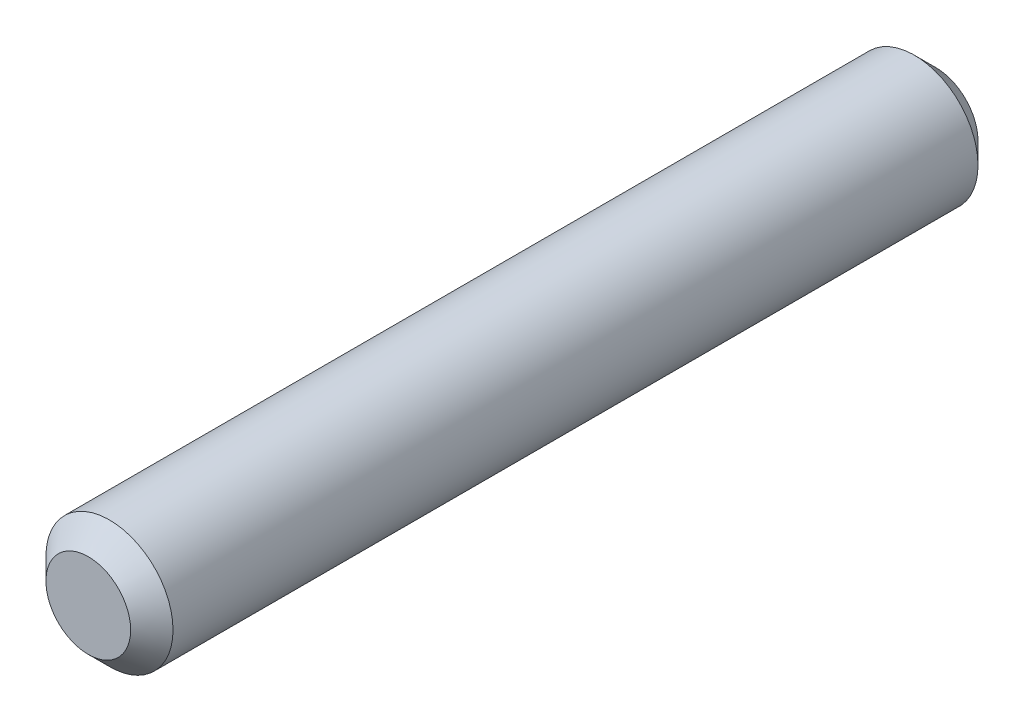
ISO-10303-21;
HEADER;
FILE_DESCRIPTION(('STEP AP214'),'2;1');
FILE_NAME('part.step','',(''),(''),'','','');
FILE_SCHEMA(('AUTOMOTIVE_DESIGN { 1 0 10303 214 1 1 1 1 }'));
ENDSEC;
DATA;
#1=APPLICATION_CONTEXT('core data for automotive mechanical design processes');
#2=APPLICATION_PROTOCOL_DEFINITION('international standard','automotive_design',2000,#1);
#3=PRODUCT_CONTEXT('',#1,'mechanical');
#4=PRODUCT('Part','Part','',(#3));
#5=PRODUCT_RELATED_PRODUCT_CATEGORY('part','',(#4));
#6=PRODUCT_DEFINITION_FORMATION('','',#4);
#7=PRODUCT_DEFINITION_CONTEXT('part definition',#1,'design');
#8=PRODUCT_DEFINITION('design','',#6,#7);
#9=PRODUCT_DEFINITION_SHAPE('','',#8);
#10=(LENGTH_UNIT() NAMED_UNIT(*) SI_UNIT(.MILLI.,.METRE.));
#11=(NAMED_UNIT(*) PLANE_ANGLE_UNIT() SI_UNIT($,.RADIAN.));
#12=(NAMED_UNIT(*) SI_UNIT($,.STERADIAN.) SOLID_ANGLE_UNIT());
#13=UNCERTAINTY_MEASURE_WITH_UNIT(LENGTH_MEASURE(1.E-05),#10,'distance_accuracy_value','');
#14=(GEOMETRIC_REPRESENTATION_CONTEXT(3) GLOBAL_UNCERTAINTY_ASSIGNED_CONTEXT((#13)) GLOBAL_UNIT_ASSIGNED_CONTEXT((#10,
#11,#12)) REPRESENTATION_CONTEXT('',''));
#15=CARTESIAN_POINT('',(0.,0.,0.));
#16=DIRECTION('',(0.,0.,1.));
#17=DIRECTION('',(1.,0.,0.));
#18=AXIS2_PLACEMENT_3D('',#15,#16,#17);
#19=CARTESIAN_POINT('',(0.,0.,5.));
#20=DIRECTION('',(0.,0.,-1.));
#21=DIRECTION('',(-1.,0.,0.));
#22=AXIS2_PLACEMENT_3D('',#19,#20,#21);
#23=CYLINDRICAL_SURFACE('',#22,0.75);
#24=CARTESIAN_POINT('',(0.,0.,-4.75));
#25=DIRECTION('',(0.,0.,1.));
#26=DIRECTION('',(1.,0.,0.));
#27=AXIS2_PLACEMENT_3D('',#24,#25,#26);
#28=CIRCLE('',#27,0.75);
#29=CARTESIAN_POINT('',(0.75,0.,-4.75));
#30=VERTEX_POINT('',#29);
#31=EDGE_CURVE('E40',#30,#30,#28,.T.);
#32=ORIENTED_EDGE('',*,*,#31,.T.);
#33=EDGE_LOOP('',(#32));
#34=FACE_BOUND('',#33,.T.);
#35=CARTESIAN_POINT('',(0.,0.,4.75));
#36=DIRECTION('',(0.,0.,1.));
#37=DIRECTION('',(1.,0.,0.));
#38=AXIS2_PLACEMENT_3D('',#35,#36,#37);
#39=CIRCLE('',#38,0.75);
#40=CARTESIAN_POINT('',(0.75,0.,4.75));
#41=VERTEX_POINT('',#40);
#42=EDGE_CURVE('E44',#41,#41,#39,.F.);
#43=ORIENTED_EDGE('',*,*,#42,.T.);
#44=EDGE_LOOP('',(#43));
#45=FACE_BOUND('',#44,.T.);
#46=ADVANCED_FACE('F29',(#34,#45),#23,.T.);
#47=CARTESIAN_POINT('',(0.,0.,5.));
#48=DIRECTION('',(0.,0.,1.));
#49=DIRECTION('',(1.,0.,0.));
#50=AXIS2_PLACEMENT_3D('',#47,#48,#49);
#51=PLANE('',#50);
#52=CARTESIAN_POINT('',(0.,0.,5.));
#53=DIRECTION('',(0.,0.,1.));
#54=DIRECTION('',(1.,0.,0.));
#55=AXIS2_PLACEMENT_3D('',#52,#53,#54);
#56=CIRCLE('',#55,0.5);
#57=CARTESIAN_POINT('',(0.5,0.,5.));
#58=VERTEX_POINT('',#57);
#59=EDGE_CURVE('E10',#58,#58,#56,.T.);
#60=ORIENTED_EDGE('',*,*,#59,.T.);
#61=EDGE_LOOP('',(#60));
#62=FACE_BOUND('',#61,.T.);
#63=ADVANCED_FACE('F60',(#62),#51,.T.);
#64=CARTESIAN_POINT('',(0.,0.,-5.));
#65=DIRECTION('',(0.,0.,1.));
#66=DIRECTION('',(1.,0.,0.));
#67=AXIS2_PLACEMENT_3D('',#64,#65,#66);
#68=PLANE('',#67);
#69=CARTESIAN_POINT('',(0.,0.,-5.));
#70=DIRECTION('',(0.,0.,1.));
#71=DIRECTION('',(1.,0.,0.));
#72=AXIS2_PLACEMENT_3D('',#69,#70,#71);
#73=CIRCLE('',#72,0.499999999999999);
#74=CARTESIAN_POINT('',(0.499999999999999,0.,-5.));
#75=VERTEX_POINT('',#74);
#76=EDGE_CURVE('E36',#75,#75,#73,.F.);
#77=ORIENTED_EDGE('',*,*,#76,.T.);
#78=EDGE_LOOP('',(#77));
#79=FACE_BOUND('',#78,.T.);
#80=ADVANCED_FACE('F57',(#79),#68,.F.);
#81=CARTESIAN_POINT('',(0.,0.,-4.75));
#82=DIRECTION('',(0.,0.,1.));
#83=DIRECTION('',(1.,0.,0.));
#84=AXIS2_PLACEMENT_3D('',#81,#82,#83);
#85=CONICAL_SURFACE('',#84,0.75,0.785398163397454);
#86=ORIENTED_EDGE('',*,*,#76,.F.);
#87=EDGE_LOOP('',(#86));
#88=FACE_BOUND('',#87,.T.);
#89=ORIENTED_EDGE('',*,*,#31,.F.);
#90=EDGE_LOOP('',(#89));
#91=FACE_BOUND('',#90,.T.);
#92=ADVANCED_FACE('F53',(#88,#91),#85,.T.);
#93=CARTESIAN_POINT('',(0.,0.,5.));
#94=DIRECTION('',(0.,0.,-1.));
#95=DIRECTION('',(-1.,0.,0.));
#96=AXIS2_PLACEMENT_3D('',#93,#94,#95);
#97=CONICAL_SURFACE('',#96,0.5,0.785398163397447);
#98=ORIENTED_EDGE('',*,*,#42,.F.);
#99=EDGE_LOOP('',(#98));
#100=FACE_BOUND('',#99,.T.);
#101=ORIENTED_EDGE('',*,*,#59,.F.);
#102=EDGE_LOOP('',(#101));
#103=FACE_BOUND('',#102,.T.);
#104=ADVANCED_FACE('F31',(#100,#103),#97,.T.);
#105=CLOSED_SHELL('',(#46,#63,#80,#92,#104));
#106=MANIFOLD_SOLID_BREP('B2',#105);
#107=ADVANCED_BREP_SHAPE_REPRESENTATION('',(#18,#106),#14);
#108=SHAPE_DEFINITION_REPRESENTATION(#9,#107);
ENDSEC;
END-ISO-10303-21;
